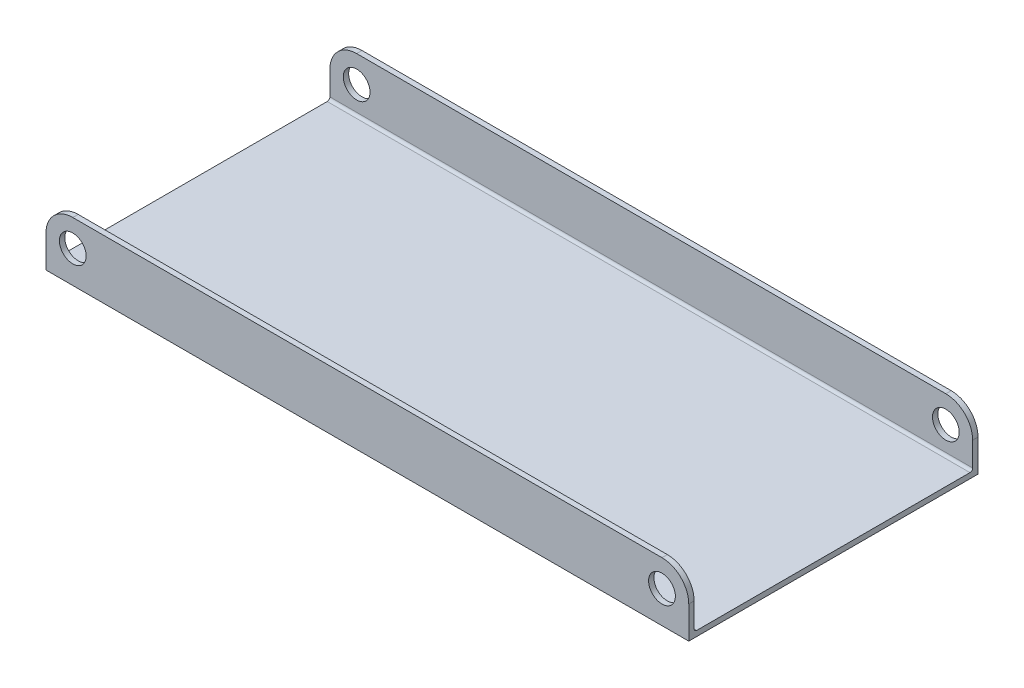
from build123d import *

# Parameters (mm, degrees)
SKETCH1_W           = 152.4
SKETCH1_H           = 1.27
SKETCH1_H_2         = 66.04
BOSS_EXTRUDE1_DEPTH = 1.27
SKETCH1_3_W         = 152.4
SKETCH1_3_H         = 1.27
BOSS_EXTRUDE2_DEPTH = 13.97
CUT_EXTRUDE1_DEPTH  = 168.702526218
SKETCH3_R           = 3.175
CUT_EXTRUDE2_DEPTH  = 168.702526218
FILLET1_R           = 0.635
FILLET2_R           = 0.635


with BuildPart() as part:
    # Sketch1 → Boss-Extrude1 (new body)
    with BuildSketch(Plane(origin=(0, 0, 0), x_dir=(1, 0, 0), z_dir=(0, 1, 0))):
        with Locations((76.2, 67.945)):
            Rectangle(SKETCH1_W, SKETCH1_H)
        with Locations((76.2, 34.29)):
            Rectangle(SKETCH1_W, SKETCH1_H_2)
        with Locations((76.2, 0.635)):
            Rectangle(SKETCH1_W, SKETCH1_H)
    extrude(amount=BOSS_EXTRUDE1_DEPTH)

    # Sketch1_3 → Boss-Extrude2 (add)
    with BuildSketch(Plane(origin=(0, 0, 0), x_dir=(1, 0, 0), z_dir=(0, 1, 0))):
        with Locations((76.2, 0.635)):
            Rectangle(SKETCH1_3_W, SKETCH1_3_H)
        with Locations((76.2, 67.945)):
            Rectangle(SKETCH1_3_W, SKETCH1_3_H)
    extrude(amount=BOSS_EXTRUDE2_DEPTH)

    # Sketch2 → Cut-Extrude1 (cut, through all)
    with BuildSketch(Plane.XY):
        with BuildLine():
            Line((0, 13.97), (0, 7.62))
            ThreePointArc((0, 7.62), (1.859871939, 12.110128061), (6.35, 13.97))
            Line((6.35, 13.97), (0, 13.97))
        make_face()
        with BuildLine():
            ThreePointArc((146.05, 13.97), (150.540128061, 12.110128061), (152.4, 7.62))
            Line((152.4, 7.62), (152.4, 13.97))
            Line((152.4, 13.97), (146.05, 13.97))
        make_face()
    extrude(amount=-CUT_EXTRUDE1_DEPTH, mode=Mode.SUBTRACT)

    # Sketch3 → Cut-Extrude2 (cut, through all)
    with BuildSketch(Plane.XY):
        with Locations((6.35, 7.62)):
            Circle(SKETCH3_R)
        with Locations((146.05, 7.62)):
            Circle(SKETCH3_R)
    extrude(amount=-CUT_EXTRUDE2_DEPTH, mode=Mode.SUBTRACT)

    # Fillet1
    fillet1_edges = [part.edges().sort_by_distance(p)[0] for p in [
        (76.2, 1.27, -67.31),
    ]]
    fillet(fillet1_edges, radius=FILLET1_R)

    # Fillet2
    fillet2_edges = [part.edges().sort_by_distance(p)[0] for p in [
        (76.2, 1.27, -1.27),
    ]]
    fillet(fillet2_edges, radius=FILLET2_R)


solid = part.part
